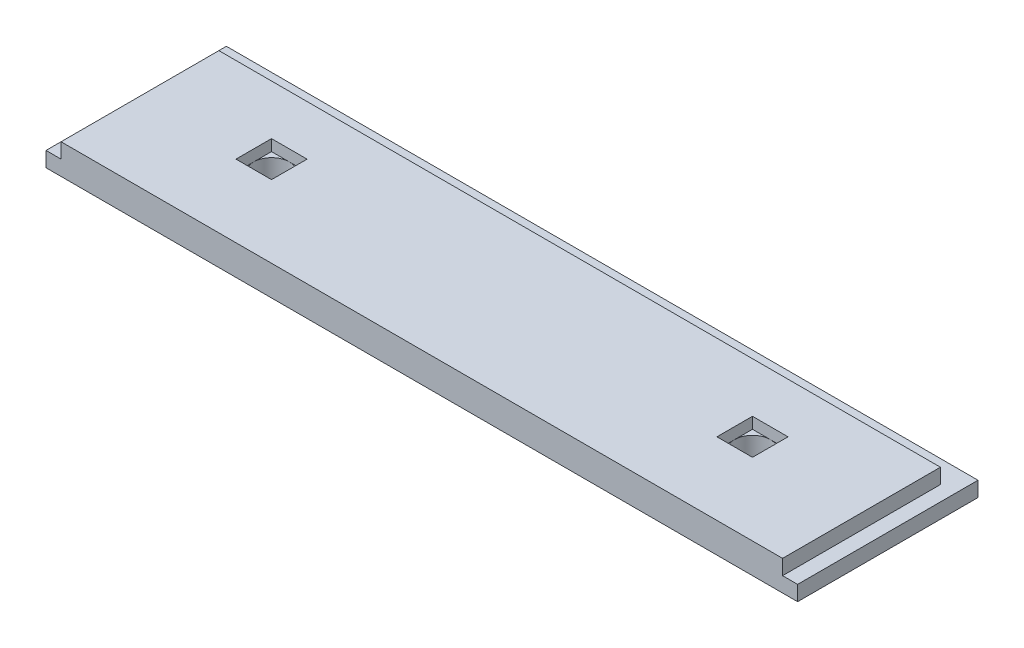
from build123d import *

# Parameters (mm, degrees)
BOSS_EXTRUDE1_DEPTH            = 609.6
SKETCH2_W                      = 120.142
SKETCH2_H                      = 120.142
CUT_EXTRUDE1_DEPTH             = 38.1
SKETCH4_R                      = 76.2
BOSS_EXTRUDE2_DEPTH            = 177.8
CUT_EXTRUDE2_REACH             = 2629.028
SKETCH5_R                      = 60.071
CUT_EXTRUDE3_REACH             = 2570.918
SKETCH6_W                      = 76.2
SKETCH6_H                      = 50.8
CUT_EXTRUDE3_DIRECTION_2_DEPTH = 2569.918379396


with BuildPart() as part:
    # Sketch1 → Boss-Extrude1 (new body)
    with BuildSketch(Plane.XY):
        Polygon((0, 0), (2540, 0), (2540, 50.8), (2489.2, 50.8), (2489.2, 101.6), (50.8, 101.6), (50.8, 50.8), (0, 50.8), align=None)
    extrude(amount=BOSS_EXTRUDE1_DEPTH)

    # Sketch2 → Cut-Extrude1 (cut)
    with BuildSketch(Plane(origin=(0, 101.6, 0), x_dir=(1, 0, 0), z_dir=(0, 1, 0))):
        with Locations((457.327, -304.8)):
            Rectangle(SKETCH2_W, SKETCH2_H)
        with Locations((2082.673, -304.8)):
            Rectangle(SKETCH2_W, SKETCH2_H)
    extrude(amount=-CUT_EXTRUDE1_DEPTH, mode=Mode.SUBTRACT)

    # Sketch4 → Boss-Extrude2 (add)
    with BuildSketch(Plane.XZ):
        with Locations(Location((457.2, 304.8, 0), (0, 0, 90))):
            Circle(SKETCH4_R)
        with Locations(Location((2082.8, 304.8, 0), (0, 0, 90))):
            Circle(SKETCH4_R)
    extrude(amount=BOSS_EXTRUDE2_DEPTH)

    # Sketch5 → Cut-Extrude2 (cut, up to next)
    with BuildSketch(Plane(origin=(0, 101.6, 0), x_dir=(1, 0, 0), z_dir=(0, 1, 0)), mode=Mode.PRIVATE) as cut_extrude2_sk1:
        with Locations(Location((457.327, -304.8, 0), (0, 0, 90))):
            Circle(SKETCH5_R)
    cut_extrude2_tool1 = extrude(cut_extrude2_sk1.sketch, amount=-CUT_EXTRUDE2_REACH, mode=Mode.PRIVATE) & part.part
    # Sketch5 → Cut-Extrude2 (cut, up to next)
    with BuildSketch(Plane(origin=(0, 101.6, 0), x_dir=(1, 0, 0), z_dir=(0, 1, 0)), mode=Mode.PRIVATE) as cut_extrude2_sk2:
        with Locations(Location((2082.673, -304.8, 0), (0, 0, 90))):
            Circle(SKETCH5_R)
    cut_extrude2_tool2 = extrude(cut_extrude2_sk2.sketch, amount=-CUT_EXTRUDE2_REACH, mode=Mode.PRIVATE) & part.part
    add(cut_extrude2_tool1.solids().sort_by_distance((457.327, 101.6, 304.8))[0], mode=Mode.SUBTRACT)
    add(cut_extrude2_tool2.solids().sort_by_distance((2082.673, 101.6, 304.8))[0], mode=Mode.SUBTRACT)

    # Sketch6 → Cut-Extrude3 (cut, up to next)
    with BuildSketch(Plane.ZY.offset(-50.8), mode=Mode.PRIVATE) as cut_extrude3_sk1:
        with Locations((38.1, 76.2)):
            Rectangle(SKETCH6_W, SKETCH6_H)
    cut_extrude3_tool1 = extrude(cut_extrude3_sk1.sketch, amount=-CUT_EXTRUDE3_REACH, mode=Mode.PRIVATE) & part.part
    add(cut_extrude3_tool1.solids().sort_by_distance((50.8, 76.2, 38.1))[0], mode=Mode.SUBTRACT)

    # Sketch6 → Cut-Extrude3 direction 2 (cut)
    with BuildSketch(Plane.ZY.offset(-50.8)):
        with Locations((38.1, 76.2)):
            Rectangle(SKETCH6_W, SKETCH6_H)
    extrude(amount=CUT_EXTRUDE3_DIRECTION_2_DEPTH, mode=Mode.SUBTRACT)


solid = part.part
